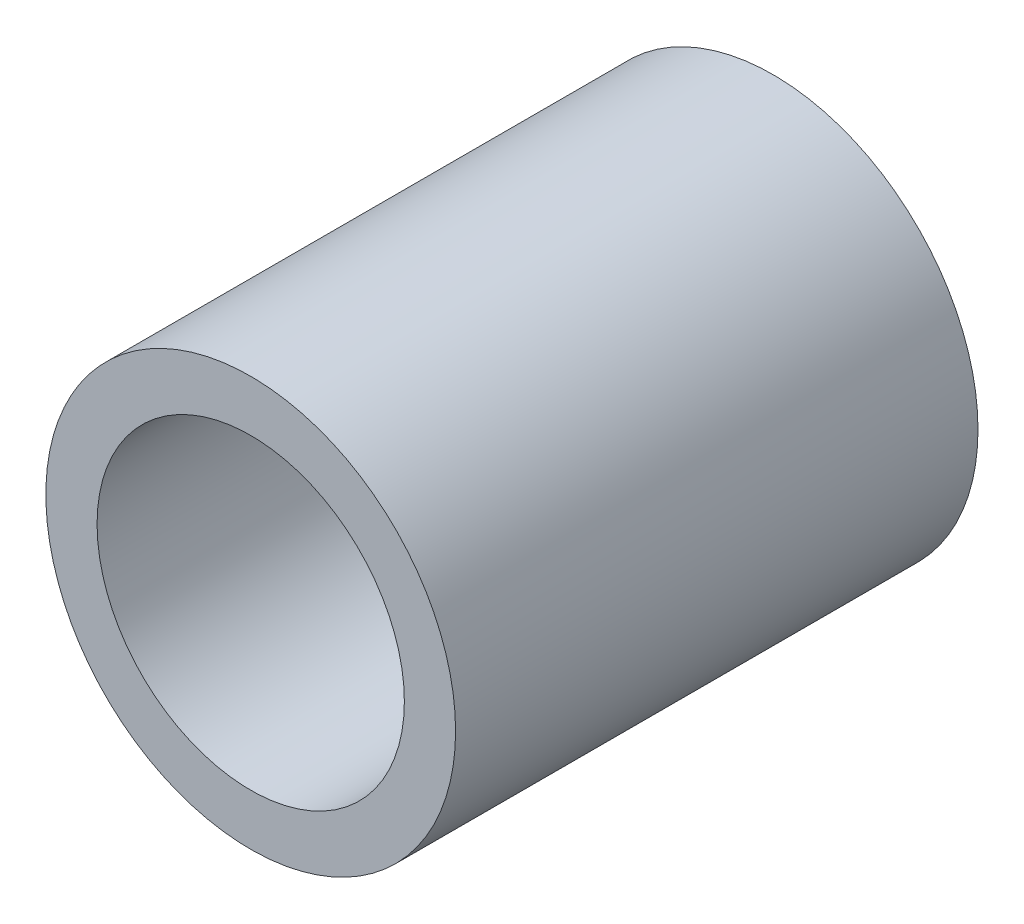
ISO-10303-21;
HEADER;
FILE_DESCRIPTION(('STEP AP214'),'2;1');
FILE_NAME('part.step','',(''),(''),'','','');
FILE_SCHEMA(('AUTOMOTIVE_DESIGN { 1 0 10303 214 1 1 1 1 }'));
ENDSEC;
DATA;
#1=APPLICATION_CONTEXT('core data for automotive mechanical design processes');
#2=APPLICATION_PROTOCOL_DEFINITION('international standard','automotive_design',2000,#1);
#3=PRODUCT_CONTEXT('',#1,'mechanical');
#4=PRODUCT('Part','Part','',(#3));
#5=PRODUCT_RELATED_PRODUCT_CATEGORY('part','',(#4));
#6=PRODUCT_DEFINITION_FORMATION('','',#4);
#7=PRODUCT_DEFINITION_CONTEXT('part definition',#1,'design');
#8=PRODUCT_DEFINITION('design','',#6,#7);
#9=PRODUCT_DEFINITION_SHAPE('','',#8);
#10=(LENGTH_UNIT() NAMED_UNIT(*) SI_UNIT(.MILLI.,.METRE.));
#11=(NAMED_UNIT(*) PLANE_ANGLE_UNIT() SI_UNIT($,.RADIAN.));
#12=(NAMED_UNIT(*) SI_UNIT($,.STERADIAN.) SOLID_ANGLE_UNIT());
#13=UNCERTAINTY_MEASURE_WITH_UNIT(LENGTH_MEASURE(1.E-05),#10,'distance_accuracy_value','');
#14=(GEOMETRIC_REPRESENTATION_CONTEXT(3) GLOBAL_UNCERTAINTY_ASSIGNED_CONTEXT((#13)) GLOBAL_UNIT_ASSIGNED_CONTEXT((#10,
#11,#12)) REPRESENTATION_CONTEXT('',''));
#15=CARTESIAN_POINT('',(0.,0.,0.));
#16=DIRECTION('',(0.,0.,1.));
#17=DIRECTION('',(1.,0.,0.));
#18=AXIS2_PLACEMENT_3D('',#15,#16,#17);
#19=CARTESIAN_POINT('',(0.,0.,25.5));
#20=DIRECTION('',(0.,0.,1.));
#21=DIRECTION('',(1.,0.,0.));
#22=AXIS2_PLACEMENT_3D('',#19,#20,#21);
#23=PLANE('',#22);
#24=CARTESIAN_POINT('',(0.,0.,25.5));
#25=DIRECTION('',(0.,0.,1.));
#26=DIRECTION('',(1.,0.,0.));
#27=AXIS2_PLACEMENT_3D('',#24,#25,#26);
#28=CIRCLE('',#27,10.);
#29=CARTESIAN_POINT('',(10.,0.,25.5));
#30=VERTEX_POINT('',#29);
#31=EDGE_CURVE('E10',#30,#30,#28,.T.);
#32=ORIENTED_EDGE('',*,*,#31,.T.);
#33=EDGE_LOOP('',(#32));
#34=FACE_BOUND('',#33,.T.);
#35=CARTESIAN_POINT('',(0.,0.,25.5));
#36=DIRECTION('',(0.,0.,1.));
#37=DIRECTION('',(1.,0.,0.));
#38=AXIS2_PLACEMENT_3D('',#35,#36,#37);
#39=CIRCLE('',#38,7.5);
#40=CARTESIAN_POINT('',(7.5,0.,25.5));
#41=VERTEX_POINT('',#40);
#42=EDGE_CURVE('E38',#41,#41,#39,.T.);
#43=ORIENTED_EDGE('',*,*,#42,.F.);
#44=EDGE_LOOP('',(#43));
#45=FACE_BOUND('',#44,.T.);
#46=ADVANCED_FACE('F27',(#34,#45),#23,.T.);
#47=CARTESIAN_POINT('',(0.,0.,0.));
#48=DIRECTION('',(0.,0.,1.));
#49=DIRECTION('',(1.,0.,0.));
#50=AXIS2_PLACEMENT_3D('',#47,#48,#49);
#51=PLANE('',#50);
#52=CARTESIAN_POINT('',(0.,0.,0.));
#53=DIRECTION('',(0.,0.,1.));
#54=DIRECTION('',(1.,0.,0.));
#55=AXIS2_PLACEMENT_3D('',#52,#53,#54);
#56=CIRCLE('',#55,10.);
#57=CARTESIAN_POINT('',(10.,0.,0.));
#58=VERTEX_POINT('',#57);
#59=EDGE_CURVE('E34',#58,#58,#56,.T.);
#60=ORIENTED_EDGE('',*,*,#59,.F.);
#61=EDGE_LOOP('',(#60));
#62=FACE_BOUND('',#61,.T.);
#63=CARTESIAN_POINT('',(0.,0.,0.));
#64=DIRECTION('',(0.,0.,1.));
#65=DIRECTION('',(1.,0.,0.));
#66=AXIS2_PLACEMENT_3D('',#63,#64,#65);
#67=CIRCLE('',#66,7.5);
#68=CARTESIAN_POINT('',(7.5,0.,0.));
#69=VERTEX_POINT('',#68);
#70=EDGE_CURVE('E42',#69,#69,#67,.T.);
#71=ORIENTED_EDGE('',*,*,#70,.T.);
#72=EDGE_LOOP('',(#71));
#73=FACE_BOUND('',#72,.T.);
#74=ADVANCED_FACE('F48',(#62,#73),#51,.F.);
#75=CARTESIAN_POINT('',(0.,0.,25.5));
#76=DIRECTION('',(0.,0.,-1.));
#77=DIRECTION('',(-1.,0.,0.));
#78=AXIS2_PLACEMENT_3D('',#75,#76,#77);
#79=CYLINDRICAL_SURFACE('',#78,10.);
#80=ORIENTED_EDGE('',*,*,#31,.F.);
#81=EDGE_LOOP('',(#80));
#82=FACE_BOUND('',#81,.T.);
#83=ORIENTED_EDGE('',*,*,#59,.T.);
#84=EDGE_LOOP('',(#83));
#85=FACE_BOUND('',#84,.T.);
#86=ADVANCED_FACE('F29',(#82,#85),#79,.T.);
#87=CARTESIAN_POINT('',(0.,0.,25.5));
#88=DIRECTION('',(0.,0.,-1.));
#89=DIRECTION('',(-1.,0.,0.));
#90=AXIS2_PLACEMENT_3D('',#87,#88,#89);
#91=CYLINDRICAL_SURFACE('',#90,7.5);
#92=ORIENTED_EDGE('',*,*,#42,.T.);
#93=EDGE_LOOP('',(#92));
#94=FACE_BOUND('',#93,.T.);
#95=ORIENTED_EDGE('',*,*,#70,.F.);
#96=EDGE_LOOP('',(#95));
#97=FACE_BOUND('',#96,.T.);
#98=ADVANCED_FACE('F50',(#94,#97),#91,.F.);
#99=CLOSED_SHELL('',(#46,#74,#86,#98));
#100=MANIFOLD_SOLID_BREP('B2',#99);
#101=ADVANCED_BREP_SHAPE_REPRESENTATION('',(#18,#100),#14);
#102=SHAPE_DEFINITION_REPRESENTATION(#9,#101);
ENDSEC;
END-ISO-10303-21;
